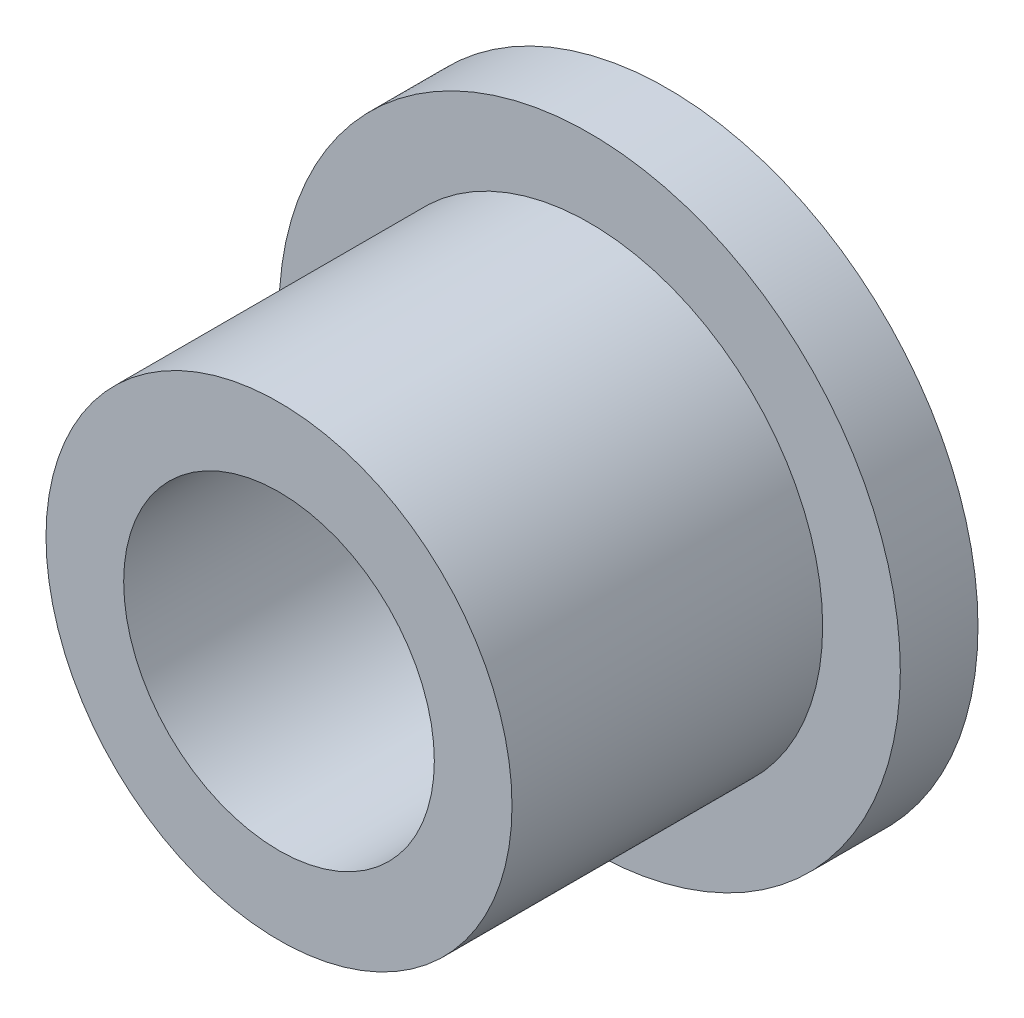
ISO-10303-21;
HEADER;
FILE_DESCRIPTION(('STEP AP214'),'2;1');
FILE_NAME('part.step','',(''),(''),'','','');
FILE_SCHEMA(('AUTOMOTIVE_DESIGN { 1 0 10303 214 1 1 1 1 }'));
ENDSEC;
DATA;
#1=APPLICATION_CONTEXT('core data for automotive mechanical design processes');
#2=APPLICATION_PROTOCOL_DEFINITION('international standard','automotive_design',2000,#1);
#3=PRODUCT_CONTEXT('',#1,'mechanical');
#4=PRODUCT('Part','Part','',(#3));
#5=PRODUCT_RELATED_PRODUCT_CATEGORY('part','',(#4));
#6=PRODUCT_DEFINITION_FORMATION('','',#4);
#7=PRODUCT_DEFINITION_CONTEXT('part definition',#1,'design');
#8=PRODUCT_DEFINITION('design','',#6,#7);
#9=PRODUCT_DEFINITION_SHAPE('','',#8);
#10=(LENGTH_UNIT() NAMED_UNIT(*) SI_UNIT(.MILLI.,.METRE.));
#11=(NAMED_UNIT(*) PLANE_ANGLE_UNIT() SI_UNIT($,.RADIAN.));
#12=(NAMED_UNIT(*) SI_UNIT($,.STERADIAN.) SOLID_ANGLE_UNIT());
#13=UNCERTAINTY_MEASURE_WITH_UNIT(LENGTH_MEASURE(1.E-05),#10,'distance_accuracy_value','');
#14=(GEOMETRIC_REPRESENTATION_CONTEXT(3) GLOBAL_UNCERTAINTY_ASSIGNED_CONTEXT((#13)) GLOBAL_UNIT_ASSIGNED_CONTEXT((#10,
#11,#12)) REPRESENTATION_CONTEXT('',''));
#15=CARTESIAN_POINT('',(0.,0.,0.));
#16=DIRECTION('',(0.,0.,1.));
#17=DIRECTION('',(1.,0.,0.));
#18=AXIS2_PLACEMENT_3D('',#15,#16,#17);
#19=CARTESIAN_POINT('',(0.,0.,2.));
#20=DIRECTION('',(0.,0.,1.));
#21=DIRECTION('',(1.,0.,0.));
#22=AXIS2_PLACEMENT_3D('',#19,#20,#21);
#23=PLANE('',#22);
#24=CARTESIAN_POINT('',(0.,0.,2.));
#25=DIRECTION('',(0.,0.,1.));
#26=DIRECTION('',(1.,0.,0.));
#27=AXIS2_PLACEMENT_3D('',#24,#25,#26);
#28=CIRCLE('',#27,8.);
#29=CARTESIAN_POINT('',(8.,0.,2.));
#30=VERTEX_POINT('',#29);
#31=EDGE_CURVE('E10',#30,#30,#28,.T.);
#32=ORIENTED_EDGE('',*,*,#31,.T.);
#33=EDGE_LOOP('',(#32));
#34=FACE_BOUND('',#33,.T.);
#35=CARTESIAN_POINT('',(0.,0.,2.));
#36=DIRECTION('',(0.,0.,1.));
#37=DIRECTION('',(1.,0.,0.));
#38=AXIS2_PLACEMENT_3D('',#35,#36,#37);
#39=CIRCLE('',#38,6.);
#40=CARTESIAN_POINT('',(6.,0.,2.));
#41=VERTEX_POINT('',#40);
#42=EDGE_CURVE('E41',#41,#41,#39,.T.);
#43=ORIENTED_EDGE('',*,*,#42,.F.);
#44=EDGE_LOOP('',(#43));
#45=FACE_BOUND('',#44,.T.);
#46=ADVANCED_FACE('F28',(#34,#45),#23,.T.);
#47=CARTESIAN_POINT('',(0.,0.,2.));
#48=DIRECTION('',(0.,0.,-1.));
#49=DIRECTION('',(-1.,0.,0.));
#50=AXIS2_PLACEMENT_3D('',#47,#48,#49);
#51=CYLINDRICAL_SURFACE('',#50,8.);
#52=ORIENTED_EDGE('',*,*,#31,.F.);
#53=EDGE_LOOP('',(#52));
#54=FACE_BOUND('',#53,.T.);
#55=CARTESIAN_POINT('',(0.,0.,0.));
#56=DIRECTION('',(0.,0.,1.));
#57=DIRECTION('',(1.,0.,0.));
#58=AXIS2_PLACEMENT_3D('',#55,#56,#57);
#59=CIRCLE('',#58,8.);
#60=CARTESIAN_POINT('',(8.,0.,0.));
#61=VERTEX_POINT('',#60);
#62=EDGE_CURVE('E32',#61,#61,#59,.T.);
#63=ORIENTED_EDGE('',*,*,#62,.T.);
#64=EDGE_LOOP('',(#63));
#65=FACE_BOUND('',#64,.T.);
#66=ADVANCED_FACE('F30',(#54,#65),#51,.T.);
#67=CARTESIAN_POINT('',(0.,0.,0.));
#68=DIRECTION('',(0.,0.,1.));
#69=DIRECTION('',(1.,0.,0.));
#70=AXIS2_PLACEMENT_3D('',#67,#68,#69);
#71=PLANE('',#70);
#72=CARTESIAN_POINT('',(0.,0.,0.));
#73=DIRECTION('',(0.,0.,1.));
#74=DIRECTION('',(1.,0.,0.));
#75=AXIS2_PLACEMENT_3D('',#72,#73,#74);
#76=CIRCLE('',#75,4.);
#77=CARTESIAN_POINT('',(4.,0.,0.));
#78=VERTEX_POINT('',#77);
#79=EDGE_CURVE('E44',#78,#78,#76,.T.);
#80=ORIENTED_EDGE('',*,*,#79,.T.);
#81=EDGE_LOOP('',(#80));
#82=FACE_BOUND('',#81,.T.);
#83=ORIENTED_EDGE('',*,*,#62,.F.);
#84=EDGE_LOOP('',(#83));
#85=FACE_BOUND('',#84,.T.);
#86=ADVANCED_FACE('F64',(#82,#85),#71,.F.);
#87=CARTESIAN_POINT('',(0.,0.,10.));
#88=DIRECTION('',(0.,0.,-1.));
#89=DIRECTION('',(-1.,0.,0.));
#90=AXIS2_PLACEMENT_3D('',#87,#88,#89);
#91=CYLINDRICAL_SURFACE('',#90,6.);
#92=CARTESIAN_POINT('',(0.,0.,10.));
#93=DIRECTION('',(0.,0.,1.));
#94=DIRECTION('',(1.,0.,0.));
#95=AXIS2_PLACEMENT_3D('',#92,#93,#94);
#96=CIRCLE('',#95,6.);
#97=CARTESIAN_POINT('',(6.,0.,10.));
#98=VERTEX_POINT('',#97);
#99=EDGE_CURVE('E39',#98,#98,#96,.T.);
#100=ORIENTED_EDGE('',*,*,#99,.F.);
#101=EDGE_LOOP('',(#100));
#102=FACE_BOUND('',#101,.T.);
#103=ORIENTED_EDGE('',*,*,#42,.T.);
#104=EDGE_LOOP('',(#103));
#105=FACE_BOUND('',#104,.T.);
#106=ADVANCED_FACE('F58',(#102,#105),#91,.T.);
#107=CARTESIAN_POINT('',(0.,0.,10.));
#108=DIRECTION('',(0.,0.,1.));
#109=DIRECTION('',(1.,0.,0.));
#110=AXIS2_PLACEMENT_3D('',#107,#108,#109);
#111=PLANE('',#110);
#112=CARTESIAN_POINT('',(0.,0.,10.));
#113=DIRECTION('',(0.,0.,1.));
#114=DIRECTION('',(1.,0.,0.));
#115=AXIS2_PLACEMENT_3D('',#112,#113,#114);
#116=CIRCLE('',#115,3.99999999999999);
#117=CARTESIAN_POINT('',(3.99999999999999,0.,10.));
#118=VERTEX_POINT('',#117);
#119=EDGE_CURVE('E49',#118,#118,#116,.T.);
#120=ORIENTED_EDGE('',*,*,#119,.F.);
#121=EDGE_LOOP('',(#120));
#122=FACE_BOUND('',#121,.T.);
#123=ORIENTED_EDGE('',*,*,#99,.T.);
#124=EDGE_LOOP('',(#123));
#125=FACE_BOUND('',#124,.T.);
#126=ADVANCED_FACE('F55',(#122,#125),#111,.T.);
#127=CARTESIAN_POINT('',(0.,0.,10.));
#128=DIRECTION('',(0.,0.,1.));
#129=DIRECTION('',(1.,0.,0.));
#130=AXIS2_PLACEMENT_3D('',#127,#128,#129);
#131=CYLINDRICAL_SURFACE('',#130,3.99999999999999);
#132=ORIENTED_EDGE('',*,*,#79,.F.);
#133=EDGE_LOOP('',(#132));
#134=FACE_BOUND('',#133,.T.);
#135=ORIENTED_EDGE('',*,*,#119,.T.);
#136=EDGE_LOOP('',(#135));
#137=FACE_BOUND('',#136,.T.);
#138=ADVANCED_FACE('F53',(#134,#137),#131,.F.);
#139=CLOSED_SHELL('',(#46,#66,#86,#106,#126,#138));
#140=MANIFOLD_SOLID_BREP('B2',#139);
#141=ADVANCED_BREP_SHAPE_REPRESENTATION('',(#18,#140),#14);
#142=SHAPE_DEFINITION_REPRESENTATION(#9,#141);
ENDSEC;
END-ISO-10303-21;
